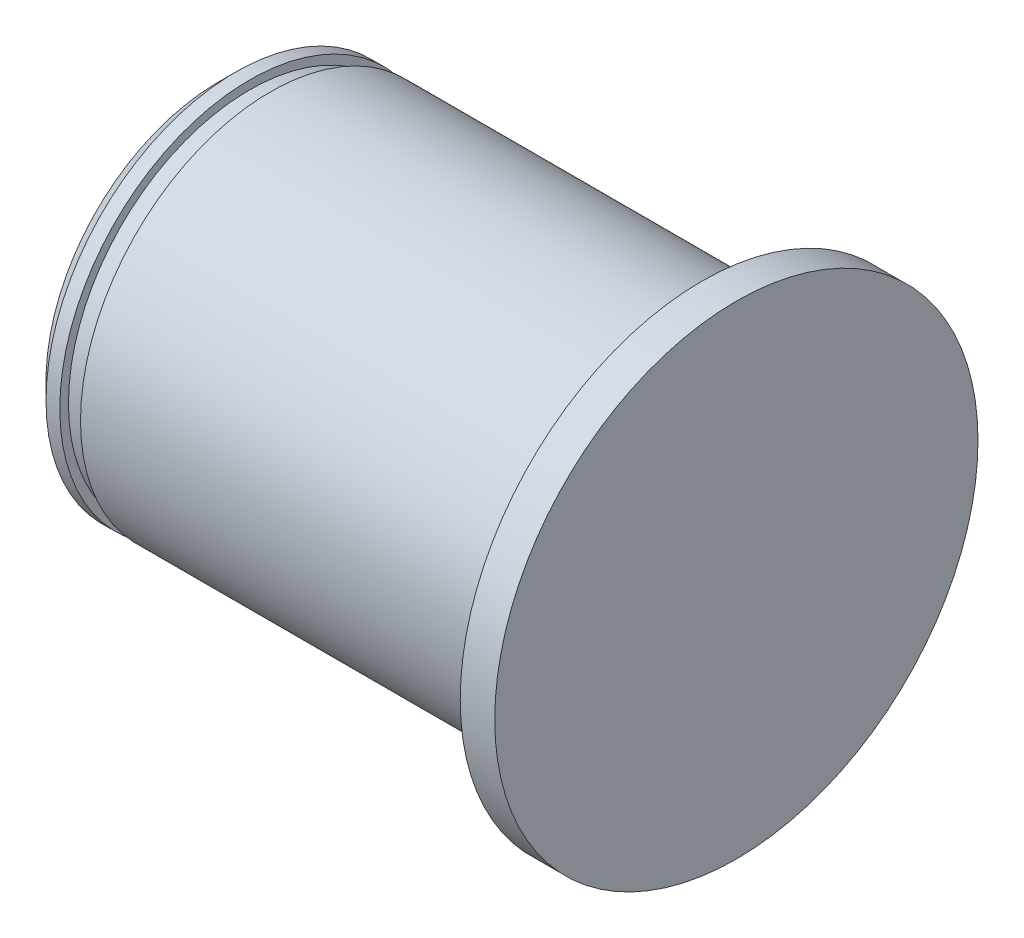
ISO-10303-21;
HEADER;
FILE_DESCRIPTION(('STEP AP214'),'2;1');
FILE_NAME('part.step','',(''),(''),'','','');
FILE_SCHEMA(('AUTOMOTIVE_DESIGN { 1 0 10303 214 1 1 1 1 }'));
ENDSEC;
DATA;
#1=APPLICATION_CONTEXT('core data for automotive mechanical design processes');
#2=APPLICATION_PROTOCOL_DEFINITION('international standard','automotive_design',2000,#1);
#3=PRODUCT_CONTEXT('',#1,'mechanical');
#4=PRODUCT('Part','Part','',(#3));
#5=PRODUCT_RELATED_PRODUCT_CATEGORY('part','',(#4));
#6=PRODUCT_DEFINITION_FORMATION('','',#4);
#7=PRODUCT_DEFINITION_CONTEXT('part definition',#1,'design');
#8=PRODUCT_DEFINITION('design','',#6,#7);
#9=PRODUCT_DEFINITION_SHAPE('','',#8);
#10=(LENGTH_UNIT() NAMED_UNIT(*) SI_UNIT(.MILLI.,.METRE.));
#11=(NAMED_UNIT(*) PLANE_ANGLE_UNIT() SI_UNIT($,.RADIAN.));
#12=(NAMED_UNIT(*) SI_UNIT($,.STERADIAN.) SOLID_ANGLE_UNIT());
#13=UNCERTAINTY_MEASURE_WITH_UNIT(LENGTH_MEASURE(1.E-05),#10,'distance_accuracy_value','');
#14=(GEOMETRIC_REPRESENTATION_CONTEXT(3) GLOBAL_UNCERTAINTY_ASSIGNED_CONTEXT((#13)) GLOBAL_UNIT_ASSIGNED_CONTEXT((#10,
#11,#12)) REPRESENTATION_CONTEXT('',''));
#15=CARTESIAN_POINT('',(0.,0.,0.));
#16=DIRECTION('',(0.,0.,1.));
#17=DIRECTION('',(1.,0.,0.));
#18=AXIS2_PLACEMENT_3D('',#15,#16,#17);
#19=CARTESIAN_POINT('',(0.,0.,0.));
#20=DIRECTION('',(-1.,0.,0.));
#21=DIRECTION('',(0.,0.,1.));
#22=AXIS2_PLACEMENT_3D('',#19,#20,#21);
#23=PLANE('',#22);
#24=CARTESIAN_POINT('',(0.,0.,0.));
#25=DIRECTION('',(-1.,0.,0.));
#26=DIRECTION('',(0.,0.,1.));
#27=AXIS2_PLACEMENT_3D('',#24,#25,#26);
#28=CIRCLE('',#27,14.);
#29=CARTESIAN_POINT('',(0.,0.,14.));
#30=VERTEX_POINT('',#29);
#31=EDGE_CURVE('E41',#30,#30,#28,.T.);
#32=ORIENTED_EDGE('',*,*,#31,.F.);
#33=EDGE_LOOP('',(#32));
#34=FACE_BOUND('',#33,.T.);
#35=ADVANCED_FACE('F30',(#34),#23,.F.);
#36=CARTESIAN_POINT('',(-30.,0.,0.));
#37=DIRECTION('',(-1.,0.,0.));
#38=DIRECTION('',(0.,0.,1.));
#39=AXIS2_PLACEMENT_3D('',#36,#37,#38);
#40=CYLINDRICAL_SURFACE('',#39,14.);
#41=CARTESIAN_POINT('',(-2.,0.,0.));
#42=DIRECTION('',(-1.,0.,0.));
#43=DIRECTION('',(0.,0.,1.));
#44=AXIS2_PLACEMENT_3D('',#41,#42,#43);
#45=CIRCLE('',#44,14.);
#46=CARTESIAN_POINT('',(-2.,0.,14.));
#47=VERTEX_POINT('',#46);
#48=EDGE_CURVE('E45',#47,#47,#45,.T.);
#49=ORIENTED_EDGE('',*,*,#48,.F.);
#50=EDGE_LOOP('',(#49));
#51=FACE_BOUND('',#50,.T.);
#52=ORIENTED_EDGE('',*,*,#31,.T.);
#53=EDGE_LOOP('',(#52));
#54=FACE_BOUND('',#53,.T.);
#55=ADVANCED_FACE('F95',(#51,#54),#40,.T.);
#56=CARTESIAN_POINT('',(-2.,14.,0.));
#57=DIRECTION('',(1.,0.,0.));
#58=DIRECTION('',(0.,0.,-1.));
#59=AXIS2_PLACEMENT_3D('',#56,#57,#58);
#60=PLANE('',#59);
#61=CARTESIAN_POINT('',(-2.,0.,0.));
#62=DIRECTION('',(-1.,0.,0.));
#63=DIRECTION('',(0.,0.,1.));
#64=AXIS2_PLACEMENT_3D('',#61,#62,#63);
#65=CIRCLE('',#64,11.);
#66=CARTESIAN_POINT('',(-2.,0.,11.));
#67=VERTEX_POINT('',#66);
#68=EDGE_CURVE('E50',#67,#67,#65,.T.);
#69=ORIENTED_EDGE('',*,*,#68,.F.);
#70=EDGE_LOOP('',(#69));
#71=FACE_BOUND('',#70,.T.);
#72=ORIENTED_EDGE('',*,*,#48,.T.);
#73=EDGE_LOOP('',(#72));
#74=FACE_BOUND('',#73,.T.);
#75=ADVANCED_FACE('F89',(#71,#74),#60,.F.);
#76=CARTESIAN_POINT('',(-30.,0.,0.));
#77=DIRECTION('',(-1.,0.,0.));
#78=DIRECTION('',(0.,0.,1.));
#79=AXIS2_PLACEMENT_3D('',#76,#77,#78);
#80=CYLINDRICAL_SURFACE('',#79,11.);
#81=CARTESIAN_POINT('',(-27.,0.,0.));
#82=DIRECTION('',(-1.,0.,0.));
#83=DIRECTION('',(0.,0.,1.));
#84=AXIS2_PLACEMENT_3D('',#81,#82,#83);
#85=CIRCLE('',#84,11.);
#86=CARTESIAN_POINT('',(-27.,0.,11.));
#87=VERTEX_POINT('',#86);
#88=EDGE_CURVE('E53',#87,#87,#85,.T.);
#89=ORIENTED_EDGE('',*,*,#88,.F.);
#90=EDGE_LOOP('',(#89));
#91=FACE_BOUND('',#90,.T.);
#92=ORIENTED_EDGE('',*,*,#68,.T.);
#93=EDGE_LOOP('',(#92));
#94=FACE_BOUND('',#93,.T.);
#95=ADVANCED_FACE('F83',(#91,#94),#80,.T.);
#96=CARTESIAN_POINT('',(-27.,11.,0.));
#97=DIRECTION('',(1.,0.,0.));
#98=DIRECTION('',(0.,0.,-1.));
#99=AXIS2_PLACEMENT_3D('',#96,#97,#98);
#100=PLANE('',#99);
#101=CARTESIAN_POINT('',(-27.,0.,0.));
#102=DIRECTION('',(-1.,0.,0.));
#103=DIRECTION('',(0.,0.,1.));
#104=AXIS2_PLACEMENT_3D('',#101,#102,#103);
#105=CIRCLE('',#104,10.5);
#106=CARTESIAN_POINT('',(-27.,0.,10.5));
#107=VERTEX_POINT('',#106);
#108=EDGE_CURVE('E56',#107,#107,#105,.T.);
#109=ORIENTED_EDGE('',*,*,#108,.F.);
#110=EDGE_LOOP('',(#109));
#111=FACE_BOUND('',#110,.T.);
#112=ORIENTED_EDGE('',*,*,#88,.T.);
#113=EDGE_LOOP('',(#112));
#114=FACE_BOUND('',#113,.T.);
#115=ADVANCED_FACE('F77',(#111,#114),#100,.F.);
#116=CARTESIAN_POINT('',(-30.,0.,0.));
#117=DIRECTION('',(-1.,0.,0.));
#118=DIRECTION('',(0.,0.,1.));
#119=AXIS2_PLACEMENT_3D('',#116,#117,#118);
#120=CYLINDRICAL_SURFACE('',#119,10.5);
#121=CARTESIAN_POINT('',(-28.2,0.,0.));
#122=DIRECTION('',(-1.,0.,0.));
#123=DIRECTION('',(0.,0.,1.));
#124=AXIS2_PLACEMENT_3D('',#121,#122,#123);
#125=CIRCLE('',#124,10.5);
#126=CARTESIAN_POINT('',(-28.2,0.,10.5));
#127=VERTEX_POINT('',#126);
#128=EDGE_CURVE('E59',#127,#127,#125,.T.);
#129=ORIENTED_EDGE('',*,*,#128,.F.);
#130=EDGE_LOOP('',(#129));
#131=FACE_BOUND('',#130,.T.);
#132=ORIENTED_EDGE('',*,*,#108,.T.);
#133=EDGE_LOOP('',(#132));
#134=FACE_BOUND('',#133,.T.);
#135=ADVANCED_FACE('F71',(#131,#134),#120,.T.);
#136=CARTESIAN_POINT('',(-28.2,10.5,0.));
#137=DIRECTION('',(-1.,0.,0.));
#138=DIRECTION('',(0.,0.,1.));
#139=AXIS2_PLACEMENT_3D('',#136,#137,#138);
#140=PLANE('',#139);
#141=CARTESIAN_POINT('',(-28.2,0.,0.));
#142=DIRECTION('',(-1.,0.,0.));
#143=DIRECTION('',(0.,0.,1.));
#144=AXIS2_PLACEMENT_3D('',#141,#142,#143);
#145=CIRCLE('',#144,11.);
#146=CARTESIAN_POINT('',(-28.2,0.,11.));
#147=VERTEX_POINT('',#146);
#148=EDGE_CURVE('E62',#147,#147,#145,.T.);
#149=ORIENTED_EDGE('',*,*,#148,.F.);
#150=EDGE_LOOP('',(#149));
#151=FACE_BOUND('',#150,.T.);
#152=ORIENTED_EDGE('',*,*,#128,.T.);
#153=EDGE_LOOP('',(#152));
#154=FACE_BOUND('',#153,.T.);
#155=ADVANCED_FACE('F68',(#151,#154),#140,.F.);
#156=CARTESIAN_POINT('',(-30.,0.,0.));
#157=DIRECTION('',(-1.,0.,0.));
#158=DIRECTION('',(0.,0.,1.));
#159=AXIS2_PLACEMENT_3D('',#156,#157,#158);
#160=CYLINDRICAL_SURFACE('',#159,11.);
#161=CARTESIAN_POINT('',(-29.,0.,0.));
#162=DIRECTION('',(1.,0.,0.));
#163=DIRECTION('',(0.,0.,-1.));
#164=AXIS2_PLACEMENT_3D('',#161,#162,#163);
#165=CIRCLE('',#164,11.);
#166=CARTESIAN_POINT('',(-29.,0.,-11.));
#167=VERTEX_POINT('',#166);
#168=EDGE_CURVE('E10',#167,#167,#165,.T.);
#169=ORIENTED_EDGE('',*,*,#168,.T.);
#170=EDGE_LOOP('',(#169));
#171=FACE_BOUND('',#170,.T.);
#172=ORIENTED_EDGE('',*,*,#148,.T.);
#173=EDGE_LOOP('',(#172));
#174=FACE_BOUND('',#173,.T.);
#175=ADVANCED_FACE('F66',(#171,#174),#160,.T.);
#176=CARTESIAN_POINT('',(-30.,11.,0.));
#177=DIRECTION('',(1.,0.,0.));
#178=DIRECTION('',(0.,0.,-1.));
#179=AXIS2_PLACEMENT_3D('',#176,#177,#178);
#180=PLANE('',#179);
#181=CARTESIAN_POINT('',(-30.,0.,0.));
#182=DIRECTION('',(1.,0.,0.));
#183=DIRECTION('',(0.,0.,-1.));
#184=AXIS2_PLACEMENT_3D('',#181,#182,#183);
#185=CIRCLE('',#184,10.);
#186=CARTESIAN_POINT('',(-30.,0.,-10.));
#187=VERTEX_POINT('',#186);
#188=EDGE_CURVE('E37',#187,#187,#185,.F.);
#189=ORIENTED_EDGE('',*,*,#188,.T.);
#190=EDGE_LOOP('',(#189));
#191=FACE_BOUND('',#190,.T.);
#192=ADVANCED_FACE('F110',(#191),#180,.F.);
#193=CARTESIAN_POINT('',(-30.,0.,0.));
#194=DIRECTION('',(1.,0.,0.));
#195=DIRECTION('',(0.,0.,-1.));
#196=AXIS2_PLACEMENT_3D('',#193,#194,#195);
#197=CONICAL_SURFACE('',#196,10.,0.785398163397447);
#198=ORIENTED_EDGE('',*,*,#168,.F.);
#199=EDGE_LOOP('',(#198));
#200=FACE_BOUND('',#199,.T.);
#201=ORIENTED_EDGE('',*,*,#188,.F.);
#202=EDGE_LOOP('',(#201));
#203=FACE_BOUND('',#202,.T.);
#204=ADVANCED_FACE('F32',(#200,#203),#197,.T.);
#205=CLOSED_SHELL('',(#35,#55,#75,#95,#115,#135,#155,#175,#192,#204));
#206=MANIFOLD_SOLID_BREP('B2',#205);
#207=ADVANCED_BREP_SHAPE_REPRESENTATION('',(#18,#206),#14);
#208=SHAPE_DEFINITION_REPRESENTATION(#9,#207);
ENDSEC;
END-ISO-10303-21;
